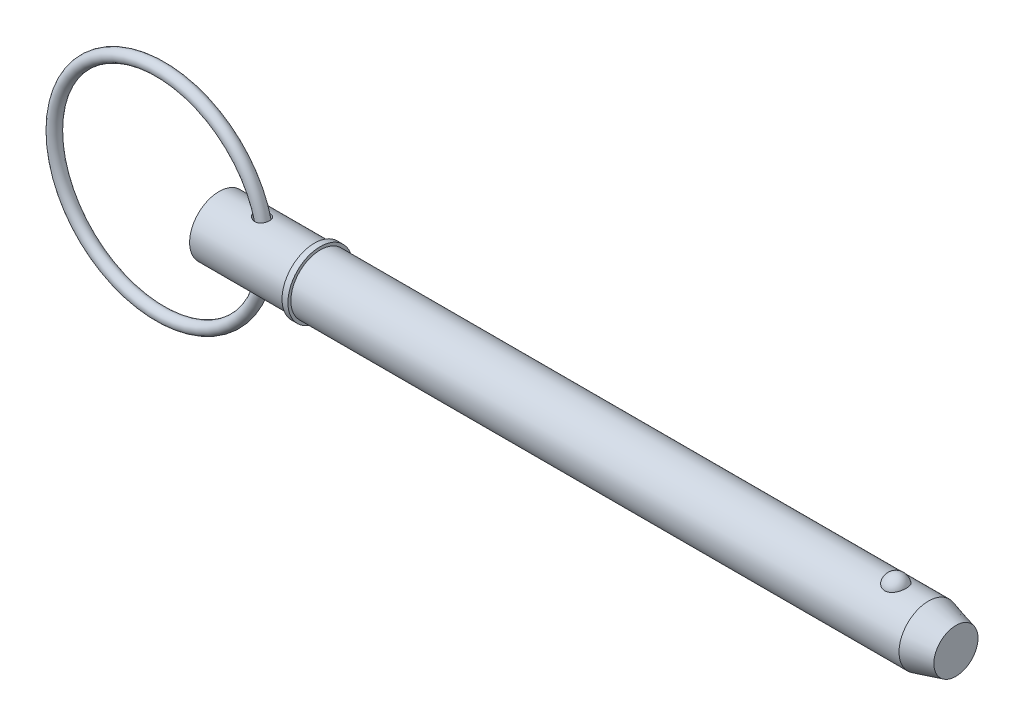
ISO-10303-21;
HEADER;
FILE_DESCRIPTION(('STEP AP214'),'2;1');
FILE_NAME('part.step','',(''),(''),'','','');
FILE_SCHEMA(('AUTOMOTIVE_DESIGN { 1 0 10303 214 1 1 1 1 }'));
ENDSEC;
DATA;
#1=APPLICATION_CONTEXT('core data for automotive mechanical design processes');
#2=APPLICATION_PROTOCOL_DEFINITION('international standard','automotive_design',2000,#1);
#3=PRODUCT_CONTEXT('',#1,'mechanical');
#4=PRODUCT('Part','Part','',(#3));
#5=PRODUCT_RELATED_PRODUCT_CATEGORY('part','',(#4));
#6=PRODUCT_DEFINITION_FORMATION('','',#4);
#7=PRODUCT_DEFINITION_CONTEXT('part definition',#1,'design');
#8=PRODUCT_DEFINITION('design','',#6,#7);
#9=PRODUCT_DEFINITION_SHAPE('','',#8);
#10=(LENGTH_UNIT() NAMED_UNIT(*) SI_UNIT(.MILLI.,.METRE.));
#11=(NAMED_UNIT(*) PLANE_ANGLE_UNIT() SI_UNIT($,.RADIAN.));
#12=(NAMED_UNIT(*) SI_UNIT($,.STERADIAN.) SOLID_ANGLE_UNIT());
#13=UNCERTAINTY_MEASURE_WITH_UNIT(LENGTH_MEASURE(1.E-05),#10,'distance_accuracy_value','');
#14=(GEOMETRIC_REPRESENTATION_CONTEXT(3) GLOBAL_UNCERTAINTY_ASSIGNED_CONTEXT((#13)) GLOBAL_UNIT_ASSIGNED_CONTEXT((#10,
#11,#12)) REPRESENTATION_CONTEXT('',''));
#15=CARTESIAN_POINT('',(0.,0.,0.));
#16=DIRECTION('',(0.,0.,1.));
#17=DIRECTION('',(1.,0.,0.));
#18=AXIS2_PLACEMENT_3D('',#15,#16,#17);
#19=CARTESIAN_POINT('',(-15.855506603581,0.,0.));
#20=DIRECTION('',(0.,0.,1.));
#21=DIRECTION('',(1.,0.,0.));
#22=AXIS2_PLACEMENT_3D('',#19,#20,#21);
#23=TOROIDAL_SURFACE('',#22,28.575,1.588);
#24=CARTESIAN_POINT('',(14.307493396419,0.,0.));
#25=VERTEX_POINT('',#24);
#26=VERTEX_LOOP('',#25);
#27=FACE_BOUND('',#26,.T.);
#28=ADVANCED_FACE('P0_F12',(#27),#23,.T.);
#29=CLOSED_SHELL('',(#28));
#30=MANIFOLD_SOLID_BREP('P0_B1',#29);
#31=CARTESIAN_POINT('',(0.,0.,0.));
#32=DIRECTION('',(1.,0.,0.));
#33=DIRECTION('',(0.,0.,-1.));
#34=AXIS2_PLACEMENT_3D('',#31,#32,#33);
#35=CYLINDRICAL_SURFACE('',#34,7.94);
#36=CARTESIAN_POINT('',(9.9064878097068,7.86092706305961,-1.11777712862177));
#37=CARTESIAN_POINT('',(9.98046148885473,7.84701054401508,-1.21564239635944));
#38=CARTESIAN_POINT('',(10.0632949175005,7.83217804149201,-1.30680329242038));
#39=CARTESIAN_POINT('',(10.243327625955,7.80247884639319,-1.47382688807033));
#40=CARTESIAN_POINT('',(10.3405572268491,7.78761214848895,-1.54965647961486));
#41=CARTESIAN_POINT('',(10.5460150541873,7.75960959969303,-1.6842723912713));
#42=CARTESIAN_POINT('',(10.654212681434,7.74646915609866,-1.74310445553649));
#43=CARTESIAN_POINT('',(10.8789333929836,7.72340979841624,-1.84259563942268));
#44=CARTESIAN_POINT('',(10.9954527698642,7.71348946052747,-1.88326279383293));
#45=CARTESIAN_POINT('',(11.2371543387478,7.69793327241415,-1.94589519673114));
#46=CARTESIAN_POINT('',(11.3624861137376,7.69242163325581,-1.96732022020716));
#47=CARTESIAN_POINT('',(11.6151110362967,7.68708151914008,-1.98809161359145));
#48=CARTESIAN_POINT('',(11.7424035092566,7.68725113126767,-1.98744541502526));
#49=CARTESIAN_POINT('',(11.9871377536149,7.69329740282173,-1.96389977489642));
#50=CARTESIAN_POINT('',(12.1047148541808,7.69883374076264,-1.94232728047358));
#51=CARTESIAN_POINT('',(12.3339179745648,7.7145667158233,-1.87886184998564));
#52=CARTESIAN_POINT('',(12.445546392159,7.72476145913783,-1.83697717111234));
#53=CARTESIAN_POINT('',(12.6521036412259,7.7477815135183,-1.73721211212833));
#54=CARTESIAN_POINT('',(12.7476463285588,7.76039274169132,-1.68054854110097));
#55=CARTESIAN_POINT('',(12.9274536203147,7.7871582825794,-1.55179691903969));
#56=CARTESIAN_POINT('',(13.0117191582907,7.8013124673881,-1.47971014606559));
#57=CARTESIAN_POINT('',(13.16544092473,7.82932755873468,-1.32341211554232));
#58=CARTESIAN_POINT('',(13.2351086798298,7.84318958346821,-1.23940873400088));
#59=CARTESIAN_POINT('',(13.3595610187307,7.86933512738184,-1.06080152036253));
#60=CARTESIAN_POINT('',(13.4143450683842,7.88161858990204,-0.966197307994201));
#61=CARTESIAN_POINT('',(13.5082288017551,7.90340571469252,-0.767990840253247));
#62=CARTESIAN_POINT('',(13.5471601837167,7.91287927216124,-0.664305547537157));
#63=CARTESIAN_POINT('',(13.6076213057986,7.92785679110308,-0.451705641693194));
#64=CARTESIAN_POINT('',(13.6291504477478,7.93336061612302,-0.342790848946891));
#65=CARTESIAN_POINT('',(13.6544025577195,7.93983472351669,-0.12204266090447));
#66=CARTESIAN_POINT('',(13.6580055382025,7.94077445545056,-0.0101946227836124));
#67=CARTESIAN_POINT('',(13.6469977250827,7.93793630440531,0.212542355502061));
#68=CARTESIAN_POINT('',(13.6323866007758,7.93415833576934,0.323431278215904));
#69=CARTESIAN_POINT('',(13.5852649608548,7.92228583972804,0.541194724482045));
#70=CARTESIAN_POINT('',(13.5527398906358,7.91418780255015,0.648065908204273));
#71=CARTESIAN_POINT('',(13.4705326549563,7.8945509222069,0.854658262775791));
#72=CARTESIAN_POINT('',(13.4208502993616,7.88301204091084,0.954379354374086));
#73=CARTESIAN_POINT('',(13.3056021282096,7.85778224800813,1.14366619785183));
#74=CARTESIAN_POINT('',(13.2400609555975,7.8440946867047,1.23324739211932));
#75=CARTESIAN_POINT('',(13.0946981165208,7.8160855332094,1.39984119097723));
#76=CARTESIAN_POINT('',(13.0148777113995,7.80176399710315,1.47685490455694));
#77=CARTESIAN_POINT('',(12.8438529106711,7.774237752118,1.61548556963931));
#78=CARTESIAN_POINT('',(12.7527554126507,7.76102428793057,1.67723263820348));
#79=CARTESIAN_POINT('',(12.5611987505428,7.73705789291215,1.78453696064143));
#80=CARTESIAN_POINT('',(12.4607407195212,7.72630466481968,1.83009617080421));
#81=CARTESIAN_POINT('',(12.2541997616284,7.70849465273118,1.90371822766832));
#82=CARTESIAN_POINT('',(12.1481665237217,7.7014098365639,1.93191408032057));
#83=CARTESIAN_POINT('',(11.9327851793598,7.69148605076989,1.97105353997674));
#84=CARTESIAN_POINT('',(11.8234367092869,7.68864754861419,1.98199524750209));
#85=CARTESIAN_POINT('',(11.6016024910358,7.68735890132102,1.98698770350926));
#86=CARTESIAN_POINT('',(11.4891069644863,7.68902083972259,1.98060702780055));
#87=CARTESIAN_POINT('',(11.2665484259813,7.6966276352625,1.95083303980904));
#88=CARTESIAN_POINT('',(11.1564861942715,7.70257384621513,1.92743434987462));
#89=CARTESIAN_POINT('',(10.9339966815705,7.71853798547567,1.86251478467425));
#90=CARTESIAN_POINT('',(10.8219140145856,7.72880438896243,1.81987394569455));
#91=CARTESIAN_POINT('',(10.6060441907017,7.75216432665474,1.7176403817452));
#92=CARTESIAN_POINT('',(10.5022611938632,7.76525926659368,1.65803922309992));
#93=CARTESIAN_POINT('',(10.3000447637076,7.79362794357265,1.51929354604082));
#94=CARTESIAN_POINT('',(10.2022480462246,7.80898310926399,1.43923272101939));
#95=CARTESIAN_POINT('',(10.0221668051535,7.83939672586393,1.26310118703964));
#96=CARTESIAN_POINT('',(9.93988168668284,7.85445518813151,1.16703109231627));
#97=CARTESIAN_POINT('',(9.79729823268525,7.88178950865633,0.964874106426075));
#98=CARTESIAN_POINT('',(9.73627994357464,7.89414970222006,0.859310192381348));
#99=CARTESIAN_POINT('',(9.63554001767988,7.91508909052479,0.638143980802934));
#100=CARTESIAN_POINT('',(9.59578986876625,7.92367334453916,0.522555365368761));
#101=CARTESIAN_POINT('',(9.54388714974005,7.93499161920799,0.300466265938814));
#102=CARTESIAN_POINT('',(9.52888458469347,7.93832727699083,0.194660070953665));
#103=CARTESIAN_POINT('',(9.51823078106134,7.94068976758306,-0.0179747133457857));
#104=CARTESIAN_POINT('',(9.52257317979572,7.93971801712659,-0.12480295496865));
#105=CARTESIAN_POINT('',(9.54911264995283,7.93386114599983,-0.326814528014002));
#106=CARTESIAN_POINT('',(9.56976509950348,7.92931471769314,-0.422217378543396));
#107=CARTESIAN_POINT('',(9.62591284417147,7.91721462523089,-0.608271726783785));
#108=CARTESIAN_POINT('',(9.66139801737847,7.90966301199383,-0.698926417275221));
#109=CARTESIAN_POINT('',(9.7317197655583,7.89515389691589,-0.844763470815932));
#110=CARTESIAN_POINT('',(9.76292633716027,7.88881879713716,-0.901801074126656));
#111=CARTESIAN_POINT('',(9.83075962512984,7.87538342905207,-1.01244242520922));
#112=CARTESIAN_POINT('',(9.86738597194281,7.86828321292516,-1.06604640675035));
#113=CARTESIAN_POINT('',(9.9064878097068,7.86092706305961,-1.11777712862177));
#114=B_SPLINE_CURVE_WITH_KNOTS('',3,(#36,#37,#38,#39,#40,#41,#42,#43,#44,#45,#46,#47,#48,#49,
#50,#51,#52,#53,#54,#55,#56,#57,#58,#59,#60,#61,#62,#63,#64,#65,#66,#67,#68,#69,#70,#71,#72,#73,
#74,#75,#76,#77,#78,#79,#80,#81,#82,#83,#84,#85,#86,#87,#88,#89,#90,#91,#92,#93,#94,#95,#96,#97,
#98,#99,#100,#101,#102,#103,#104,#105,#106,#107,#108,#109,#110,#111,#112,#113),.UNSPECIFIED.,
.T.,.F.,(4,2,2,2,2,2,2,2,2,2,2,2,2,2,2,2,2,2,2,2,2,2,2,2,2,2,2,2,2,2,2,2,2,2,2,2,2,2,4),(0.,
0.370138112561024,0.741067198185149,1.11098852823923,1.48074607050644,1.86058657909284,
2.24029919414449,2.59740885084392,2.95437345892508,3.2881332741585,3.6218654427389,
3.95036374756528,4.27887384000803,4.61078596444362,4.94270949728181,5.27685177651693,
5.61100012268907,5.94542035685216,6.27984429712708,6.61375187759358,6.94762997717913,
7.27855592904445,7.60944187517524,7.93776058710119,8.26611544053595,8.60272268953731,
8.93943635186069,9.29895306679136,9.65864886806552,10.0387340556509,10.4188046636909,
10.7843533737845,11.1494107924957,11.4683925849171,11.7872694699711,12.0791172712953,
12.3707662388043,12.5664313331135,12.7620830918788),.UNSPECIFIED.);
#115=CARTESIAN_POINT('',(9.9064878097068,7.86092706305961,-1.11777712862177));
#116=VERTEX_POINT('',#115);
#117=EDGE_CURVE('P1_E42',#116,#116,#114,.T.);
#118=ORIENTED_EDGE('',*,*,#117,.T.);
#119=EDGE_LOOP('',(#118));
#120=FACE_BOUND('',#119,.T.);
#121=CARTESIAN_POINT('',(0.,0.,0.));
#122=DIRECTION('',(1.,0.,0.));
#123=DIRECTION('',(0.,0.,-1.));
#124=AXIS2_PLACEMENT_3D('',#121,#122,#123);
#125=CIRCLE('',#124,7.94);
#126=CARTESIAN_POINT('',(0.,0.,-7.94));
#127=VERTEX_POINT('',#126);
#128=EDGE_CURVE('P1_E9',#127,#127,#125,.T.);
#129=ORIENTED_EDGE('',*,*,#128,.T.);
#130=EDGE_LOOP('',(#129));
#131=FACE_BOUND('',#130,.T.);
#132=CARTESIAN_POINT('',(25.722,0.,0.));
#133=DIRECTION('',(1.,0.,0.));
#134=DIRECTION('',(0.,0.,-1.));
#135=AXIS2_PLACEMENT_3D('',#132,#133,#134);
#136=CIRCLE('',#135,7.94);
#137=CARTESIAN_POINT('',(25.722,0.,-7.94));
#138=VERTEX_POINT('',#137);
#139=EDGE_CURVE('P1_E25',#138,#138,#136,.T.);
#140=ORIENTED_EDGE('',*,*,#139,.F.);
#141=EDGE_LOOP('',(#140));
#142=FACE_BOUND('',#141,.T.);
#143=CARTESIAN_POINT('',(9.9064878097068,-7.86092706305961,-1.11777712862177));
#144=CARTESIAN_POINT('',(9.84378768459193,-7.87272256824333,-1.03482250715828));
#145=CARTESIAN_POINT('',(9.7874122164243,-7.88386682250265,-0.947002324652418));
#146=CARTESIAN_POINT('',(9.68947008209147,-7.90377389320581,-0.763202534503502));
#147=CARTESIAN_POINT('',(9.64789384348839,-7.91253824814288,-0.667228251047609));
#148=CARTESIAN_POINT('',(9.58141396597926,-7.92676779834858,-0.468898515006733));
#149=CARTESIAN_POINT('',(9.55658638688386,-7.93221793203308,-0.366516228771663));
#150=CARTESIAN_POINT('',(9.525398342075,-7.9390896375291,-0.158837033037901));
#151=CARTESIAN_POINT('',(9.51903196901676,-7.94051249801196,-0.0535410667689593));
#152=CARTESIAN_POINT('',(9.5249639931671,-7.93919670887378,0.149856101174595));
#153=CARTESIAN_POINT('',(9.53611757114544,-7.9367132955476,0.247994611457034));
#154=CARTESIAN_POINT('',(9.57435037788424,-7.92833496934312,0.440949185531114));
#155=CARTESIAN_POINT('',(9.60143086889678,-7.92243978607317,0.535764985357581));
#156=CARTESIAN_POINT('',(9.67027872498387,-7.90782830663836,0.720026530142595));
#157=CARTESIAN_POINT('',(9.71210005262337,-7.89910165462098,0.809451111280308));
#158=CARTESIAN_POINT('',(9.80864905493,-7.87966534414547,0.980775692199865));
#159=CARTESIAN_POINT('',(9.86338092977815,-7.86895504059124,1.06267323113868));
#160=CARTESIAN_POINT('',(9.99009906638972,-7.84531573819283,1.22559225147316));
#161=CARTESIAN_POINT('',(10.0632770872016,-7.8322718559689,1.30566871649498));
#162=CARTESIAN_POINT('',(10.2208237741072,-7.80611237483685,1.45392159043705));
#163=CARTESIAN_POINT('',(10.3051986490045,-7.79299674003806,1.52209134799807));
#164=CARTESIAN_POINT('',(10.4935539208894,-7.76638841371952,1.65280871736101));
#165=CARTESIAN_POINT('',(10.5986730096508,-7.75303312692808,1.71374951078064));
#166=CARTESIAN_POINT('',(10.8175805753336,-7.72920597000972,1.81820073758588));
#167=CARTESIAN_POINT('',(10.9313721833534,-7.71873514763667,1.86170483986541));
#168=CARTESIAN_POINT('',(11.1696833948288,-7.70161777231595,1.93133079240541));
#169=CARTESIAN_POINT('',(11.2944525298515,-7.69514907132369,1.95665138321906));
#170=CARTESIAN_POINT('',(11.5466607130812,-7.6877908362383,1.98537345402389));
#171=CARTESIAN_POINT('',(11.6740986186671,-7.68689896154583,1.98878412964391));
#172=CARTESIAN_POINT('',(11.9206005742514,-7.690938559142,1.97309854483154));
#173=CARTESIAN_POINT('',(12.0397453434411,-7.69555832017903,1.95520713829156));
#174=CARTESIAN_POINT('',(12.2727177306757,-7.70968728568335,1.89872693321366));
#175=CARTESIAN_POINT('',(12.3865475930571,-7.71919440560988,1.86014695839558));
#176=CARTESIAN_POINT('',(12.5975118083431,-7.74115679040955,1.76641559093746));
#177=CARTESIAN_POINT('',(12.6952552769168,-7.75336701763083,1.71257254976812));
#178=CARTESIAN_POINT('',(12.8798510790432,-7.77962828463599,1.58901145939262));
#179=CARTESIAN_POINT('',(12.9667044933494,-7.79367914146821,1.51929498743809));
#180=CARTESIAN_POINT('',(13.1254818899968,-7.82172079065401,1.36751778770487));
#181=CARTESIAN_POINT('',(13.1976693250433,-7.83570718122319,1.28573131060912));
#182=CARTESIAN_POINT('',(13.3274495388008,-7.86236718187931,1.11111271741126));
#183=CARTESIAN_POINT('',(13.3850418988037,-7.87504075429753,1.01828028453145));
#184=CARTESIAN_POINT('',(13.4847470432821,-7.89782512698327,0.823214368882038));
#185=CARTESIAN_POINT('',(13.5267056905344,-7.90791011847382,0.720899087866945));
#186=CARTESIAN_POINT('',(13.5933891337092,-7.92427335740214,0.510509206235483));
#187=CARTESIAN_POINT('',(13.6181132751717,-7.9305514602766,0.402434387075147));
#188=CARTESIAN_POINT('',(13.6498843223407,-7.93866355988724,0.182728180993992));
#189=CARTESIAN_POINT('',(13.6567982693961,-7.94046412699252,0.07107630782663));
#190=CARTESIAN_POINT('',(13.6524060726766,-7.93933046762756,-0.151845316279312));
#191=CARTESIAN_POINT('',(13.6410996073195,-7.93639615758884,-0.26311506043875));
#192=CARTESIAN_POINT('',(13.6005023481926,-7.92610202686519,-0.482238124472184));
#193=CARTESIAN_POINT('',(13.571192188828,-7.91873744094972,-0.590087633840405));
#194=CARTESIAN_POINT('',(13.495246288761,-7.90037565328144,-0.799178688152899));
#195=CARTESIAN_POINT('',(13.4486102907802,-7.88937839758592,-0.900420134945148));
#196=CARTESIAN_POINT('',(13.3391817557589,-7.86497175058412,-1.09328280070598));
#197=CARTESIAN_POINT('',(13.2764083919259,-7.85156522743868,-1.18491525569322));
#198=CARTESIAN_POINT('',(13.1362355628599,-7.8238261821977,-1.35604994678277));
#199=CARTESIAN_POINT('',(13.0588372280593,-7.80949373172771,-1.43555311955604));
#200=CARTESIAN_POINT('',(12.8921392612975,-7.78164292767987,-1.57955181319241));
#201=CARTESIAN_POINT('',(12.8029410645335,-7.76811892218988,-1.64416363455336));
#202=CARTESIAN_POINT('',(12.6146622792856,-7.74328422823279,-1.75742016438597));
#203=CARTESIAN_POINT('',(12.5155829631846,-7.73197325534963,-1.80606692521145));
#204=CARTESIAN_POINT('',(12.31135301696,-7.71289290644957,-1.88588502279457));
#205=CARTESIAN_POINT('',(12.2062651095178,-7.70509254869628,-1.91720981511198));
#206=CARTESIAN_POINT('',(11.9922253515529,-7.69365188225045,-1.96261878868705));
#207=CARTESIAN_POINT('',(11.8832731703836,-7.69001193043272,-1.97670149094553));
#208=CARTESIAN_POINT('',(11.662174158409,-7.6871142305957,-1.98794112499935));
#209=CARTESIAN_POINT('',(11.5500082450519,-7.6879499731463,-1.98473694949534));
#210=CARTESIAN_POINT('',(11.3276038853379,-7.69396349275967,-1.96129119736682));
#211=CARTESIAN_POINT('',(11.2173659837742,-7.6991424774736,-1.94104488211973));
#212=CARTESIAN_POINT('',(10.9943151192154,-7.71363470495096,-1.8826578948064));
#213=CARTESIAN_POINT('',(10.8818004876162,-7.72319478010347,-1.8434396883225));
#214=CARTESIAN_POINT('',(10.6644693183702,-7.74534199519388,-1.74804607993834));
#215=CARTESIAN_POINT('',(10.5596578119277,-7.75793109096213,-1.69185971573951));
#216=CARTESIAN_POINT('',(10.3538333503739,-7.78563853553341,-1.5595801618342));
#217=CARTESIAN_POINT('',(10.2535123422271,-7.80086820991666,-1.48242881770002));
#218=CARTESIAN_POINT('',(10.0678634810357,-7.83136022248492,-1.31182139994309));
#219=CARTESIAN_POINT('',(9.98252491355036,-7.84662252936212,-1.21837707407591));
#220=CARTESIAN_POINT('',(9.9064878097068,-7.86092706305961,-1.11777712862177));
#221=B_SPLINE_CURVE_WITH_KNOTS('',3,(#143,#144,#145,#146,#147,#148,#149,#150,#151,#152,#153,
#154,#155,#156,#157,#158,#159,#160,#161,#162,#163,#164,#165,#166,#167,#168,#169,#170,#171,#172,
#173,#174,#175,#176,#177,#178,#179,#180,#181,#182,#183,#184,#185,#186,#187,#188,#189,#190,#191,
#192,#193,#194,#195,#196,#197,#198,#199,#200,#201,#202,#203,#204,#205,#206,#207,#208,#209,#210,
#211,#212,#213,#214,#215,#216,#217,#218,#219,#220),.UNSPECIFIED.,.T.,.F.,(4,2,2,2,2,2,2,2,2,2,2,
2,2,2,2,2,2,2,2,2,2,2,2,2,2,2,2,2,2,2,2,2,2,2,2,2,2,2,4),(0.,0.313593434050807,
0.626983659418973,0.941787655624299,1.25649090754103,1.55146990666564,1.84647228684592,
2.14256601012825,2.4387561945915,2.76521830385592,3.09186220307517,3.45696288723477,
3.82219601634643,4.20267276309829,4.58298981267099,4.94277962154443,5.30241610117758,
5.63754619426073,5.97264300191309,6.301049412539,6.62946524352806,6.96103833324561,
7.29262401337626,7.62667800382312,7.96073789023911,8.29515773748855,8.6295825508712,
8.96361184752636,9.29761533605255,9.62891449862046,9.96017105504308,10.288443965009,
10.616745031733,10.951930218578,11.2872086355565,11.6442788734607,12.0015802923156,
12.3821516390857,12.762449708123),.UNSPECIFIED.);
#222=CARTESIAN_POINT('',(9.9064878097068,-7.86092706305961,-1.11777712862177));
#223=VERTEX_POINT('',#222);
#224=EDGE_CURVE('P1_E17',#223,#223,#221,.T.);
#225=ORIENTED_EDGE('',*,*,#224,.T.);
#226=EDGE_LOOP('',(#225));
#227=FACE_BOUND('',#226,.T.);
#228=ADVANCED_FACE('P1_F13',(#120,#131,#142,#227),#35,.T.);
#229=CARTESIAN_POINT('',(0.,0.,0.));
#230=DIRECTION('',(1.,0.,0.));
#231=DIRECTION('',(0.,0.,-1.));
#232=AXIS2_PLACEMENT_3D('',#229,#230,#231);
#233=CYLINDRICAL_SURFACE('',#232,7.94);
#234=CARTESIAN_POINT('',(191.351879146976,0.,0.));
#235=DIRECTION('',(1.,0.,0.));
#236=DIRECTION('',(0.,0.,-1.));
#237=AXIS2_PLACEMENT_3D('',#234,#235,#236);
#238=CIRCLE('',#237,7.94);
#239=CARTESIAN_POINT('',(191.351879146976,0.,-7.94));
#240=VERTEX_POINT('',#239);
#241=EDGE_CURVE('P1_E99',#240,#240,#238,.T.);
#242=ORIENTED_EDGE('',*,*,#241,.F.);
#243=EDGE_LOOP('',(#242));
#244=FACE_BOUND('',#243,.T.);
#245=CARTESIAN_POINT('',(27.31,0.,0.));
#246=DIRECTION('',(1.,0.,0.));
#247=DIRECTION('',(0.,0.,-1.));
#248=AXIS2_PLACEMENT_3D('',#245,#246,#247);
#249=CIRCLE('',#248,7.94);
#250=CARTESIAN_POINT('',(27.31,0.,-7.94));
#251=VERTEX_POINT('',#250);
#252=EDGE_CURVE('P1_E96',#251,#251,#249,.T.);
#253=ORIENTED_EDGE('',*,*,#252,.T.);
#254=EDGE_LOOP('',(#253));
#255=FACE_BOUND('',#254,.T.);
#256=CARTESIAN_POINT('',(182.544907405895,7.37767842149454,2.93486986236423));
#257=CARTESIAN_POINT('',(182.392749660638,7.3776732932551,2.93487505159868));
#258=CARTESIAN_POINT('',(182.240632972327,7.38258419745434,2.92262454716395));
#259=CARTESIAN_POINT('',(181.940928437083,7.40163229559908,2.87404196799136));
#260=CARTESIAN_POINT('',(181.793339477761,7.41576720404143,2.83771585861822));
#261=CARTESIAN_POINT('',(181.507018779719,7.45161576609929,2.74218769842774));
#262=CARTESIAN_POINT('',(181.368274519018,7.47331841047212,2.68301886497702));
#263=CARTESIAN_POINT('',(181.102882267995,7.52194082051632,2.54350967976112));
#264=CARTESIAN_POINT('',(180.976236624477,7.54886159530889,2.46316523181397));
#265=CARTESIAN_POINT('',(180.734534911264,7.60594671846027,2.28090375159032));
#266=CARTESIAN_POINT('',(180.619906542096,7.63618114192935,2.1784421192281));
#267=CARTESIAN_POINT('',(180.408878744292,7.69614046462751,1.95608495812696));
#268=CARTESIAN_POINT('',(180.312482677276,7.72586526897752,1.83618622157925));
#269=CARTESIAN_POINT('',(180.135938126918,7.78314821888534,1.57628086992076));
#270=CARTESIAN_POINT('',(180.056707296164,7.81055035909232,1.43561546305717));
#271=CARTESIAN_POINT('',(179.921797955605,7.85879631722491,1.14236334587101));
#272=CARTESIAN_POINT('',(179.866121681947,7.87963951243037,0.989775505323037));
#273=CARTESIAN_POINT('',(179.77881215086,7.91289645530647,0.674619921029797));
#274=CARTESIAN_POINT('',(179.74753090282,7.92518652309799,0.511941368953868));
#275=CARTESIAN_POINT('',(179.710975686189,7.93958930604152,0.183247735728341));
#276=CARTESIAN_POINT('',(179.705701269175,7.94170219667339,0.0172327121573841));
#277=CARTESIAN_POINT('',(179.721231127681,7.93554931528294,-0.312672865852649));
#278=CARTESIAN_POINT('',(179.741925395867,7.92732732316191,-0.476569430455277));
#279=CARTESIAN_POINT('',(179.80878655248,7.90141534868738,-0.79830524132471));
#280=CARTESIAN_POINT('',(179.854953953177,7.88372517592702,-0.956144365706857));
#281=CARTESIAN_POINT('',(179.971898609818,7.84066230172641,-1.26152073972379));
#282=CARTESIAN_POINT('',(180.042704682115,7.81528060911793,-1.40904568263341));
#283=CARTESIAN_POINT('',(180.207478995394,7.75948672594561,-1.68950598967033));
#284=CARTESIAN_POINT('',(180.301448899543,7.72907417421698,-1.82244030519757));
#285=CARTESIAN_POINT('',(180.510839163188,7.66640424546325,-2.07032792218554));
#286=CARTESIAN_POINT('',(180.626315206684,7.63414223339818,-2.18523308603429));
#287=CARTESIAN_POINT('',(180.8759006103,7.57149681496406,-2.39329737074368));
#288=CARTESIAN_POINT('',(181.010008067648,7.54111321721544,-2.48645870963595));
#289=CARTESIAN_POINT('',(181.290111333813,7.48650742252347,-2.64628132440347));
#290=CARTESIAN_POINT('',(181.435760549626,7.46215900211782,-2.71350554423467));
#291=CARTESIAN_POINT('',(181.737425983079,7.42171253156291,-2.82226614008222));
#292=CARTESIAN_POINT('',(181.893438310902,7.40561140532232,-2.86381209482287));
#293=CARTESIAN_POINT('',(182.202970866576,7.3842679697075,-2.9183907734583));
#294=CARTESIAN_POINT('',(182.356222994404,7.37852109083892,-2.93275024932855));
#295=CARTESIAN_POINT('',(182.663070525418,7.37700973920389,-2.93655208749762));
#296=CARTESIAN_POINT('',(182.816665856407,7.38124333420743,-2.92599927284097));
#297=CARTESIAN_POINT('',(183.114990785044,7.39890635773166,-2.88102897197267));
#298=CARTESIAN_POINT('',(183.259848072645,7.41205491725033,-2.84733999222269));
#299=CARTESIAN_POINT('',(183.54164329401,7.445801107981,-2.75788206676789));
#300=CARTESIAN_POINT('',(183.678580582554,7.46639934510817,-2.70211132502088));
#301=CARTESIAN_POINT('',(183.944061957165,7.51339098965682,-2.56858908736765));
#302=CARTESIAN_POINT('',(184.072354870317,7.53990200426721,-2.4903806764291));
#303=CARTESIAN_POINT('',(184.314244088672,7.59569503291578,-2.31462737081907));
#304=CARTESIAN_POINT('',(184.427837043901,7.6249776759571,-2.21707808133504));
#305=CARTESIAN_POINT('',(184.64322156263,7.68489473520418,-1.99982049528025));
#306=CARTESIAN_POINT('',(184.744148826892,7.71552419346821,-1.87925337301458));
#307=CARTESIAN_POINT('',(184.925186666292,7.77353016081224,-1.6226882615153));
#308=CARTESIAN_POINT('',(185.005293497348,7.80090608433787,-1.48668750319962));
#309=CARTESIAN_POINT('',(185.145361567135,7.85047992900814,-1.1981841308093));
#310=CARTESIAN_POINT('',(185.204587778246,7.87248183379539,-1.04529016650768));
#311=CARTESIAN_POINT('',(185.297982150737,7.90785114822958,-0.731080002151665));
#312=CARTESIAN_POINT('',(185.332149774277,7.92121837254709,-0.569763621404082));
#313=CARTESIAN_POINT('',(185.374795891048,7.93797834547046,-0.242812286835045));
#314=CARTESIAN_POINT('',(185.383204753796,7.94134405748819,-0.0771668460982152));
#315=CARTESIAN_POINT('',(185.373962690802,7.93767937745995,0.253276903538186));
#316=CARTESIAN_POINT('',(185.356312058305,7.93064910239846,0.418075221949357));
#317=CARTESIAN_POINT('',(185.295424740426,7.90695571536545,0.741525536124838));
#318=CARTESIAN_POINT('',(185.252281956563,7.8903279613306,0.900197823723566));
#319=CARTESIAN_POINT('',(185.14135358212,7.84916386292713,1.20759654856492));
#320=CARTESIAN_POINT('',(185.07356656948,7.82462706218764,1.35632241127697));
#321=CARTESIAN_POINT('',(184.914371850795,7.77006699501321,1.64032869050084));
#322=CARTESIAN_POINT('',(184.822861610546,7.74002008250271,1.7755471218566));
#323=CARTESIAN_POINT('',(184.618296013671,7.67774175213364,2.0280064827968));
#324=CARTESIAN_POINT('',(184.505241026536,7.64551037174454,2.14524772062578));
#325=CARTESIAN_POINT('',(184.260831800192,7.58265895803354,2.35778002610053));
#326=CARTESIAN_POINT('',(184.129583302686,7.5520309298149,2.45319004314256));
#327=CARTESIAN_POINT('',(183.851601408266,7.49579792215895,2.61999897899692));
#328=CARTESIAN_POINT('',(183.704867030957,7.4701932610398,2.69139637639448));
#329=CARTESIAN_POINT('',(183.392947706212,7.42622216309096,2.8105324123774));
#330=CARTESIAN_POINT('',(183.227220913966,7.40825002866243,2.85700910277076));
#331=CARTESIAN_POINT('',(182.889279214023,7.38398348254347,2.9191685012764));
#332=CARTESIAN_POINT('',(182.71706702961,7.3776842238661,2.93486399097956));
#333=CARTESIAN_POINT('',(182.544907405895,7.37767842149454,2.93486986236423));
#334=B_SPLINE_CURVE_WITH_KNOTS('',3,(#256,#257,#258,#259,#260,#261,#262,#263,#264,#265,#266,
#267,#268,#269,#270,#271,#272,#273,#274,#275,#276,#277,#278,#279,#280,#281,#282,#283,#284,#285,
#286,#287,#288,#289,#290,#291,#292,#293,#294,#295,#296,#297,#298,#299,#300,#301,#302,#303,#304,
#305,#306,#307,#308,#309,#310,#311,#312,#313,#314,#315,#316,#317,#318,#319,#320,#321,#322,#323,
#324,#325,#326,#327,#328,#329,#330,#331,#332,#333),.UNSPECIFIED.,.T.,.F.,(4,2,2,2,2,2,2,2,2,2,2,
2,2,2,2,2,2,2,2,2,2,2,2,2,2,2,2,2,2,2,2,2,2,2,2,2,2,2,4),(0.,0.455841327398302,
0.911569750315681,1.36663794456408,1.82179423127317,2.2897898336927,2.75787163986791,
3.24685368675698,3.73588214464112,4.23184282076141,4.72779494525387,5.22165321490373,
5.71552141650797,6.2099691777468,6.7044524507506,7.20023431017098,7.69596557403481,
8.18023418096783,8.66432203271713,9.1241069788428,9.58380291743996,10.0296503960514,
10.4755341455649,10.9312349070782,11.3870393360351,11.8654416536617,12.3439299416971,
12.8378875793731,13.3318558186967,13.8271581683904,14.3224549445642,14.8159385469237,
15.3094506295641,15.8051323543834,16.3008055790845,16.7937101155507,17.2866458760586,
17.8026240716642,18.3183879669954),.UNSPECIFIED.);
#335=CARTESIAN_POINT('',(182.544907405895,7.37767842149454,2.93486986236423));
#336=VERTEX_POINT('',#335);
#337=EDGE_CURVE('P1_E34',#336,#336,#334,.T.);
#338=ORIENTED_EDGE('',*,*,#337,.T.);
#339=EDGE_LOOP('',(#338));
#340=FACE_BOUND('',#339,.T.);
#341=ADVANCED_FACE('P1_F46',(#244,#255,#340),#233,.T.);
#342=CARTESIAN_POINT('',(0.,0.,0.));
#343=DIRECTION('',(-1.,0.,0.));
#344=DIRECTION('',(0.,0.,1.));
#345=AXIS2_PLACEMENT_3D('',#342,#343,#344);
#346=PLANE('',#345);
#347=ORIENTED_EDGE('',*,*,#128,.F.);
#348=EDGE_LOOP('',(#347));
#349=FACE_BOUND('',#348,.T.);
#350=ADVANCED_FACE('P1_F15',(#349),#346,.T.);
#351=CARTESIAN_POINT('',(25.722,7.94,0.));
#352=DIRECTION('',(-1.,0.,0.));
#353=DIRECTION('',(0.,0.,1.));
#354=AXIS2_PLACEMENT_3D('',#351,#352,#353);
#355=PLANE('',#354);
#356=ORIENTED_EDGE('',*,*,#139,.T.);
#357=EDGE_LOOP('',(#356));
#358=FACE_BOUND('',#357,.T.);
#359=CARTESIAN_POINT('',(25.722,0.,0.));
#360=DIRECTION('',(1.,0.,0.));
#361=DIRECTION('',(0.,0.,-1.));
#362=AXIS2_PLACEMENT_3D('',#359,#360,#361);
#363=CIRCLE('',#362,8.734);
#364=CARTESIAN_POINT('',(25.722,0.,-8.734));
#365=VERTEX_POINT('',#364);
#366=EDGE_CURVE('P1_E30',#365,#365,#363,.T.);
#367=ORIENTED_EDGE('',*,*,#366,.F.);
#368=EDGE_LOOP('',(#367));
#369=FACE_BOUND('',#368,.T.);
#370=ADVANCED_FACE('P1_F81',(#358,#369),#355,.T.);
#371=CARTESIAN_POINT('',(0.,0.,0.));
#372=DIRECTION('',(1.,0.,0.));
#373=DIRECTION('',(0.,0.,-1.));
#374=AXIS2_PLACEMENT_3D('',#371,#372,#373);
#375=CYLINDRICAL_SURFACE('',#374,8.734);
#376=ORIENTED_EDGE('',*,*,#366,.T.);
#377=EDGE_LOOP('',(#376));
#378=FACE_BOUND('',#377,.T.);
#379=CARTESIAN_POINT('',(27.31,0.,0.));
#380=DIRECTION('',(1.,0.,0.));
#381=DIRECTION('',(0.,0.,-1.));
#382=AXIS2_PLACEMENT_3D('',#379,#380,#381);
#383=CIRCLE('',#382,8.734);
#384=CARTESIAN_POINT('',(27.31,0.,-8.734));
#385=VERTEX_POINT('',#384);
#386=EDGE_CURVE('P1_E95',#385,#385,#383,.T.);
#387=ORIENTED_EDGE('',*,*,#386,.F.);
#388=EDGE_LOOP('',(#387));
#389=FACE_BOUND('',#388,.T.);
#390=ADVANCED_FACE('P1_F68',(#378,#389),#375,.T.);
#391=CARTESIAN_POINT('',(27.31,8.734,0.));
#392=DIRECTION('',(1.,0.,0.));
#393=DIRECTION('',(0.,0.,-1.));
#394=AXIS2_PLACEMENT_3D('',#391,#392,#393);
#395=PLANE('',#394);
#396=ORIENTED_EDGE('',*,*,#386,.T.);
#397=EDGE_LOOP('',(#396));
#398=FACE_BOUND('',#397,.T.);
#399=ORIENTED_EDGE('',*,*,#252,.F.);
#400=EDGE_LOOP('',(#399));
#401=FACE_BOUND('',#400,.T.);
#402=ADVANCED_FACE('P1_F62',(#398,#401),#395,.T.);
#403=CARTESIAN_POINT('',(198.76,0.,0.));
#404=DIRECTION('',(-1.,0.,0.));
#405=DIRECTION('',(0.,0.,1.));
#406=AXIS2_PLACEMENT_3D('',#403,#404,#405);
#407=CONICAL_SURFACE('',#406,5.95500000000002,0.261799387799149);
#408=ORIENTED_EDGE('',*,*,#241,.T.);
#409=EDGE_LOOP('',(#408));
#410=FACE_BOUND('',#409,.T.);
#411=CARTESIAN_POINT('',(198.76,0.,0.));
#412=DIRECTION('',(1.,0.,0.));
#413=DIRECTION('',(0.,0.,-1.));
#414=AXIS2_PLACEMENT_3D('',#411,#412,#413);
#415=CIRCLE('',#414,5.95500000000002);
#416=CARTESIAN_POINT('',(198.76,0.,-5.95500000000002));
#417=VERTEX_POINT('',#416);
#418=EDGE_CURVE('P1_E41',#417,#417,#415,.T.);
#419=ORIENTED_EDGE('',*,*,#418,.F.);
#420=EDGE_LOOP('',(#419));
#421=FACE_BOUND('',#420,.T.);
#422=ADVANCED_FACE('P1_F59',(#410,#421),#407,.T.);
#423=CARTESIAN_POINT('',(198.76,5.95500000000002,0.));
#424=DIRECTION('',(1.,0.,0.));
#425=DIRECTION('',(0.,0.,-1.));
#426=AXIS2_PLACEMENT_3D('',#423,#424,#425);
#427=PLANE('',#426);
#428=ORIENTED_EDGE('',*,*,#418,.T.);
#429=EDGE_LOOP('',(#428));
#430=FACE_BOUND('',#429,.T.);
#431=ADVANCED_FACE('P1_F55',(#430),#427,.T.);
#432=CARTESIAN_POINT('',(182.544907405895,7.146,0.));
#433=DIRECTION('',(-1.,0.,0.));
#434=DIRECTION('',(0.,1.,0.));
#435=AXIS2_PLACEMENT_3D('',#432,#433,#434);
#436=SPHERICAL_SURFACE('',#435,2.944);
#437=ORIENTED_EDGE('',*,*,#337,.F.);
#438=EDGE_LOOP('',(#437));
#439=FACE_BOUND('',#438,.T.);
#440=ADVANCED_FACE('P1_F50',(#439),#436,.T.);
#441=CARTESIAN_POINT('',(-15.855506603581,0.,0.));
#442=DIRECTION('',(0.,0.,1.));
#443=DIRECTION('',(1.,0.,0.));
#444=AXIS2_PLACEMENT_3D('',#441,#442,#443);
#445=TOROIDAL_SURFACE('',#444,28.575,1.985);
#446=ORIENTED_EDGE('',*,*,#224,.F.);
#447=EDGE_LOOP('',(#446));
#448=FACE_BOUND('',#447,.T.);
#449=ORIENTED_EDGE('',*,*,#117,.F.);
#450=EDGE_LOOP('',(#449));
#451=FACE_BOUND('',#450,.T.);
#452=ADVANCED_FACE('P1_F54',(#448,#451),#445,.F.);
#453=CLOSED_SHELL('',(#228,#341,#350,#370,#390,#402,#422,#431,#440,#452));
#454=MANIFOLD_SOLID_BREP('P1_B1',#453);
#455=ADVANCED_BREP_SHAPE_REPRESENTATION('',(#18,#30,#454),#14);
#456=SHAPE_DEFINITION_REPRESENTATION(#9,#455);
ENDSEC;
END-ISO-10303-21;
